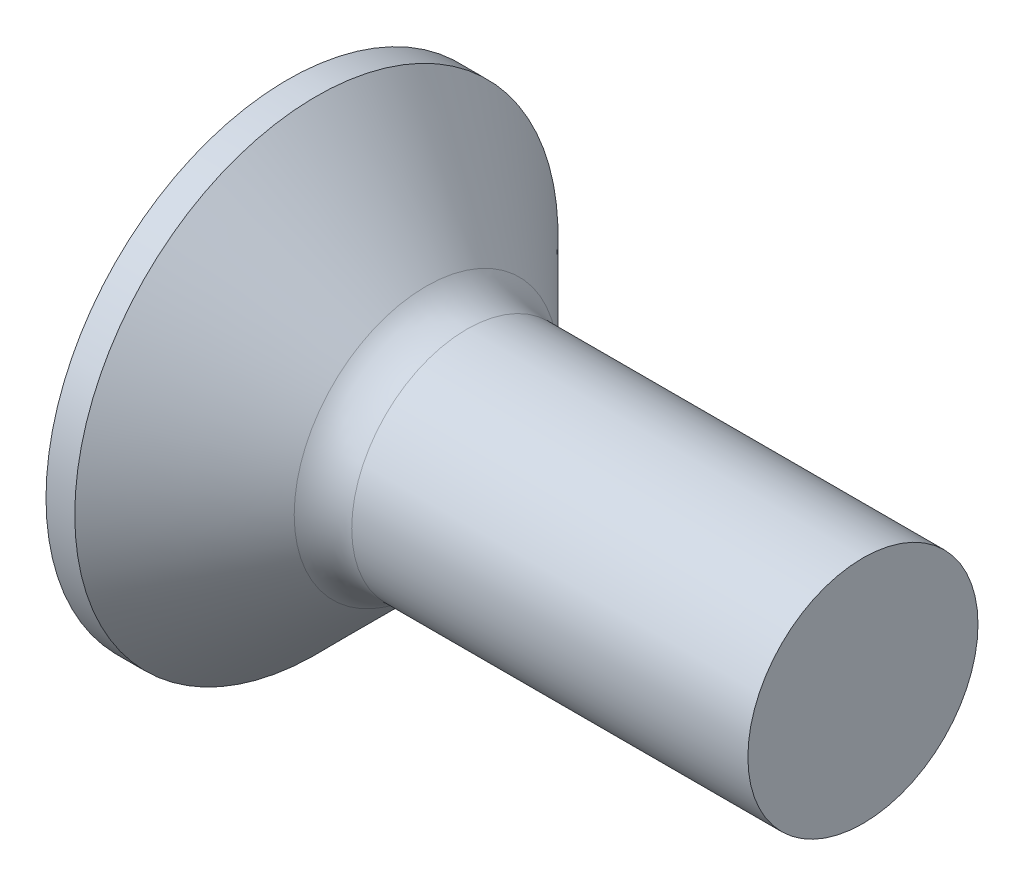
ISO-10303-21;
HEADER;
FILE_DESCRIPTION(('STEP AP214'),'2;1');
FILE_NAME('part.step','',(''),(''),'','','');
FILE_SCHEMA(('AUTOMOTIVE_DESIGN { 1 0 10303 214 1 1 1 1 }'));
ENDSEC;
DATA;
#1=APPLICATION_CONTEXT('core data for automotive mechanical design processes');
#2=APPLICATION_PROTOCOL_DEFINITION('international standard','automotive_design',2000,#1);
#3=PRODUCT_CONTEXT('',#1,'mechanical');
#4=PRODUCT('Part','Part','',(#3));
#5=PRODUCT_RELATED_PRODUCT_CATEGORY('part','',(#4));
#6=PRODUCT_DEFINITION_FORMATION('','',#4);
#7=PRODUCT_DEFINITION_CONTEXT('part definition',#1,'design');
#8=PRODUCT_DEFINITION('design','',#6,#7);
#9=PRODUCT_DEFINITION_SHAPE('','',#8);
#10=(LENGTH_UNIT() NAMED_UNIT(*) SI_UNIT(.MILLI.,.METRE.));
#11=(NAMED_UNIT(*) PLANE_ANGLE_UNIT() SI_UNIT($,.RADIAN.));
#12=(NAMED_UNIT(*) SI_UNIT($,.STERADIAN.) SOLID_ANGLE_UNIT());
#13=UNCERTAINTY_MEASURE_WITH_UNIT(LENGTH_MEASURE(1.E-05),#10,'distance_accuracy_value','');
#14=(GEOMETRIC_REPRESENTATION_CONTEXT(3) GLOBAL_UNCERTAINTY_ASSIGNED_CONTEXT((#13)) GLOBAL_UNIT_ASSIGNED_CONTEXT((#10,
#11,#12)) REPRESENTATION_CONTEXT('',''));
#15=CARTESIAN_POINT('',(0.,0.,0.));
#16=DIRECTION('',(0.,0.,1.));
#17=DIRECTION('',(1.,0.,0.));
#18=AXIS2_PLACEMENT_3D('',#15,#16,#17);
#19=CARTESIAN_POINT('',(2.51,-0.948560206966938,0.515));
#20=DIRECTION('',(0.,0.,-1.));
#21=DIRECTION('',(0.,1.,0.));
#22=AXIS2_PLACEMENT_3D('',#19,#20,#21);
#23=PLANE('',#22);
#24=DIRECTION('',(0.,-1.,0.));
#25=VECTOR('',#24,1.);
#26=CARTESIAN_POINT('',(0.,2.2,0.515));
#27=LINE('',#26,#25);
#28=CARTESIAN_POINT('',(0.,-0.887981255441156,0.515));
#29=VERTEX_POINT('',#28);
#30=CARTESIAN_POINT('',(0.,-2.2,0.515));
#31=VERTEX_POINT('',#30);
#32=EDGE_CURVE('E304',#29,#31,#27,.T.);
#33=ORIENTED_EDGE('',*,*,#32,.F.);
#34=CARTESIAN_POINT('',(-1.54977564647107,-1.01130800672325,0.515));
#35=CARTESIAN_POINT('',(-1.23788517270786,-0.986826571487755,0.515));
#36=CARTESIAN_POINT('',(-0.92600773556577,-0.962176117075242,0.515));
#37=CARTESIAN_POINT('',(-0.302275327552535,-0.912414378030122,0.515));
#38=CARTESIAN_POINT('',(0.0095796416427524,-0.88730307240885,0.515));
#39=CARTESIAN_POINT('',(0.477326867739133,-0.849200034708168,0.515));
#40=CARTESIAN_POINT('',(0.633236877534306,-0.836426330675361,0.515));
#41=CARTESIAN_POINT('',(0.945041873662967,-0.810710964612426,0.515));
#42=CARTESIAN_POINT('',(1.10093686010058,-0.797769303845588,0.515));
#43=CARTESIAN_POINT('',(1.41270333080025,-0.771692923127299,0.515));
#44=CARTESIAN_POINT('',(1.568574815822,-0.758558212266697,0.515));
#45=CARTESIAN_POINT('',(1.88030267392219,-0.732062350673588,0.515));
#46=CARTESIAN_POINT('',(2.03615904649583,-0.718701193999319,0.515));
#47=CARTESIAN_POINT('',(2.39015155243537,-0.688049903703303,0.515));
#48=CARTESIAN_POINT('',(2.58828060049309,-0.670677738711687,0.515));
#49=CARTESIAN_POINT('',(2.98448796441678,-0.63539350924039,0.515));
#50=CARTESIAN_POINT('',(3.18256628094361,-0.617481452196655,0.515));
#51=CARTESIAN_POINT('',(3.57863215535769,-0.58096323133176,0.515));
#52=CARTESIAN_POINT('',(3.77661972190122,-0.562357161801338,0.515));
#53=CARTESIAN_POINT('',(4.17251625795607,-0.524212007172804,0.515));
#54=CARTESIAN_POINT('',(4.37042522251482,-0.504672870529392,0.515));
#55=CARTESIAN_POINT('',(4.76621979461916,-0.464285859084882,0.515));
#56=CARTESIAN_POINT('',(4.96410533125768,-0.443437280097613,0.515000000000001));
#57=CARTESIAN_POINT('',(5.26075347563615,-0.410686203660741,0.515000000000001));
#58=CARTESIAN_POINT('',(5.35959766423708,-0.399523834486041,0.515000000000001));
#59=CARTESIAN_POINT('',(5.55721694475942,-0.376561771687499,0.515000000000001));
#60=CARTESIAN_POINT('',(5.65599203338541,-0.364762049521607,0.515000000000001));
#61=CARTESIAN_POINT('',(5.85350341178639,-0.340311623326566,0.515000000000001));
#62=CARTESIAN_POINT('',(5.95223963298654,-0.327660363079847,0.515000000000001));
#63=CARTESIAN_POINT('',(6.14954565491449,-0.301187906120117,0.515000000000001));
#64=CARTESIAN_POINT('',(6.24811547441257,-0.28736685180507,0.515000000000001));
#65=CARTESIAN_POINT('',(6.39580251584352,-0.265292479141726,0.515000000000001));
#66=CARTESIAN_POINT('',(6.44501926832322,-0.257707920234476,0.515000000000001));
#67=CARTESIAN_POINT('',(6.54335575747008,-0.241951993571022,0.515000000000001));
#68=CARTESIAN_POINT('',(6.59247550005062,-0.233780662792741,0.515000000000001));
#69=CARTESIAN_POINT('',(6.69060451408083,-0.216664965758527,0.515000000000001));
#70=CARTESIAN_POINT('',(6.73961373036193,-0.207720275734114,0.515000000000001));
#71=CARTESIAN_POINT('',(6.83741121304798,-0.188649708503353,0.515000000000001));
#72=CARTESIAN_POINT('',(6.8861994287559,-0.17852357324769,0.515000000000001));
#73=CARTESIAN_POINT('',(6.93482152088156,-0.167602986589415,0.515000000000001));
#74=B_SPLINE_CURVE_WITH_KNOTS('',3,(#34,#35,#36,#37,#38,#39,#40,#41,#42,#43,#44,#45,#46,#47,#48,
#49,#50,#51,#52,#53,#54,#55,#56,#57,#58,#59,#60,#61,#62,#63,#64,#65,#66,#67,#68,#69,#70,#71,#72,
#73),.UNSPECIFIED.,.F.,.F.,(4,2,2,2,2,2,2,2,2,2,2,2,2,2,2,2,2,2,2,4),(0.,0.938549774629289,
1.87714240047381,2.34643955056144,2.81573317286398,3.28500476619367,3.75428869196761,
4.35095567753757,4.94761444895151,5.54419244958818,6.14080344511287,6.73773807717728,
7.0361540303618,7.33458335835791,7.63320954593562,7.93179943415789,8.08118980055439,
8.23057076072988,8.38001456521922,8.52949107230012),.UNSPECIFIED.);
#75=CARTESIAN_POINT('',(2.51,-0.677477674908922,0.514999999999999));
#76=VERTEX_POINT('',#75);
#77=EDGE_CURVE('E191',#29,#76,#74,.T.);
#78=ORIENTED_EDGE('',*,*,#77,.T.);
#79=DIRECTION('',(0.,-1.,0.));
#80=VECTOR('',#79,1.);
#81=CARTESIAN_POINT('',(2.51,0.948560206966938,0.515));
#82=LINE('',#81,#80);
#83=CARTESIAN_POINT('',(2.51,-0.948560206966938,0.515));
#84=VERTEX_POINT('',#83);
#85=EDGE_CURVE('E328',#76,#84,#82,.T.);
#86=ORIENTED_EDGE('',*,*,#85,.T.);
#87=DIRECTION('',(0.89493436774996,0.446197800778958,0.));
#88=VECTOR('',#87,1.);
#89=CARTESIAN_POINT('',(0.,-2.2,0.515));
#90=LINE('',#89,#88);
#91=EDGE_CURVE('E315',#31,#84,#90,.T.);
#92=ORIENTED_EDGE('',*,*,#91,.F.);
#93=EDGE_LOOP('',(#33,#78,#86,#92));
#94=FACE_BOUND('',#93,.T.);
#95=ADVANCED_FACE('F35',(#94),#23,.T.);
#96=CARTESIAN_POINT('',(2.51,0.948560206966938,0.515));
#97=VERTEX_POINT('',#96);
#98=CARTESIAN_POINT('',(2.51,0.677477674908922,0.514999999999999));
#99=VERTEX_POINT('',#98);
#100=EDGE_CURVE('E330',#97,#99,#82,.T.);
#101=ORIENTED_EDGE('',*,*,#100,.T.);
#102=CARTESIAN_POINT('',(-1.54977564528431,1.01130800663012,0.515));
#103=CARTESIAN_POINT('',(-1.23788517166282,0.986826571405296,0.515));
#104=CARTESIAN_POINT('',(-0.926007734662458,0.962176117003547,0.515));
#105=CARTESIAN_POINT('',(-0.302275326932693,0.91241437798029,0.515));
#106=CARTESIAN_POINT('',(0.0095796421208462,0.887303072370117,0.515));
#107=CARTESIAN_POINT('',(0.477326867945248,0.849200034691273,0.515));
#108=CARTESIAN_POINT('',(0.63323687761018,0.836426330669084,0.515));
#109=CARTESIAN_POINT('',(0.945041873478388,0.810710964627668,0.515));
#110=CARTESIAN_POINT('',(1.10093685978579,0.797769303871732,0.515));
#111=CARTESIAN_POINT('',(1.41270333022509,0.771692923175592,0.515));
#112=CARTESIAN_POINT('',(1.56857481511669,0.758558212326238,0.515));
#113=CARTESIAN_POINT('',(1.8803026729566,0.732062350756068,0.515));
#114=CARTESIAN_POINT('',(2.03615904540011,0.718701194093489,0.515));
#115=CARTESIAN_POINT('',(2.39015155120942,0.688049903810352,0.515));
#116=CARTESIAN_POINT('',(2.58828059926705,0.670677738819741,0.515));
#117=CARTESIAN_POINT('',(2.98448796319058,0.635393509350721,0.515));
#118=CARTESIAN_POINT('',(3.18256627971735,0.617481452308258,0.515));
#119=CARTESIAN_POINT('',(3.57863215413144,0.580963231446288,0.515));
#120=CARTESIAN_POINT('',(3.77661972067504,0.56235716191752,0.515));
#121=CARTESIAN_POINT('',(4.17251625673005,0.524212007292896,0.515));
#122=CARTESIAN_POINT('',(4.37042522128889,0.504672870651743,0.515));
#123=CARTESIAN_POINT('',(4.76621979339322,0.464285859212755,0.515));
#124=CARTESIAN_POINT('',(4.96410533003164,0.443437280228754,0.515));
#125=CARTESIAN_POINT('',(5.26075347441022,0.410686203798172,0.515));
#126=CARTESIAN_POINT('',(5.35959766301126,0.399523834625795,0.515));
#127=CARTESIAN_POINT('',(5.5572169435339,0.376561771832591,0.515));
#128=CARTESIAN_POINT('',(5.65599203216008,0.364762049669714,0.515000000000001));
#129=CARTESIAN_POINT('',(5.85350341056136,0.340311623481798,0.515000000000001));
#130=CARTESIAN_POINT('',(5.95223963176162,0.327660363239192,0.515000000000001));
#131=CARTESIAN_POINT('',(6.14954565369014,0.301187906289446,0.515000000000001));
#132=CARTESIAN_POINT('',(6.24811547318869,0.28736685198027,0.515000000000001));
#133=CARTESIAN_POINT('',(6.39580251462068,0.265292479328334,0.515000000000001));
#134=CARTESIAN_POINT('',(6.44501926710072,0.257707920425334,0.515000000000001));
#135=CARTESIAN_POINT('',(6.54335575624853,0.241951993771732,0.515000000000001));
#136=CARTESIAN_POINT('',(6.5924754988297,0.233780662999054,0.515000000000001));
#137=CARTESIAN_POINT('',(6.69060451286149,0.216664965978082,0.515000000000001));
#138=CARTESIAN_POINT('',(6.73961372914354,0.207720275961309,0.515000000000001));
#139=CARTESIAN_POINT('',(6.83741121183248,0.18864970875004,0.515000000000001));
#140=CARTESIAN_POINT('',(6.88619942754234,0.178523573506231,0.515000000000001));
#141=CARTESIAN_POINT('',(6.9348215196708,0.167602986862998,0.515000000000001));
#142=B_SPLINE_CURVE_WITH_KNOTS('',3,(#102,#103,#104,#105,#106,#107,#108,#109,#110,#111,#112,
#113,#114,#115,#116,#117,#118,#119,#120,#121,#122,#123,#124,#125,#126,#127,#128,#129,#130,#131,
#132,#133,#134,#135,#136,#137,#138,#139,#140,#141),.UNSPECIFIED.,.F.,.F.,(4,2,2,2,2,2,2,2,2,2,2,
2,2,2,2,2,2,2,2,4),(0.,0.938549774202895,1.87714239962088,2.34643954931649,2.81573317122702,
3.2850047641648,3.75428868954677,4.35095567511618,4.9476144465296,5.544192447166,
6.1408034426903,6.73773807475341,7.03615402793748,7.33458335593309,7.63320954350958,
7.93179943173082,8.08118979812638,8.23057075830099,8.38001456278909,8.5294910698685),.UNSPECIFIED.);
#143=CARTESIAN_POINT('',(0.,0.887981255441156,0.515));
#144=VERTEX_POINT('',#143);
#145=EDGE_CURVE('E185',#99,#144,#142,.F.);
#146=ORIENTED_EDGE('',*,*,#145,.T.);
#147=CARTESIAN_POINT('',(0.,2.2,0.515));
#148=VERTEX_POINT('',#147);
#149=EDGE_CURVE('E306',#148,#144,#27,.T.);
#150=ORIENTED_EDGE('',*,*,#149,.F.);
#151=DIRECTION('',(0.89493436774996,-0.446197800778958,0.));
#152=VECTOR('',#151,1.);
#153=CARTESIAN_POINT('',(0.,2.2,0.515));
#154=LINE('',#153,#152);
#155=EDGE_CURVE('E63',#148,#97,#154,.T.);
#156=ORIENTED_EDGE('',*,*,#155,.T.);
#157=EDGE_LOOP('',(#101,#146,#150,#156));
#158=FACE_BOUND('',#157,.T.);
#159=ADVANCED_FACE('F167',(#158),#23,.T.);
#160=CARTESIAN_POINT('',(2.51,0.948560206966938,-0.515));
#161=DIRECTION('',(0.,0.,1.));
#162=DIRECTION('',(1.,0.,0.));
#163=AXIS2_PLACEMENT_3D('',#160,#161,#162);
#164=PLANE('',#163);
#165=DIRECTION('',(0.,1.,0.));
#166=VECTOR('',#165,1.);
#167=CARTESIAN_POINT('',(2.51,-0.948560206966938,-0.515));
#168=LINE('',#167,#166);
#169=CARTESIAN_POINT('',(2.51,-0.948560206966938,-0.515));
#170=VERTEX_POINT('',#169);
#171=CARTESIAN_POINT('',(2.51,-0.677477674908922,-0.514999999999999));
#172=VERTEX_POINT('',#171);
#173=EDGE_CURVE('E329',#170,#172,#168,.T.);
#174=ORIENTED_EDGE('',*,*,#173,.T.);
#175=CARTESIAN_POINT('',(-1.54977564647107,-1.01130800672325,-0.514999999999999));
#176=CARTESIAN_POINT('',(-1.23788517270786,-0.986826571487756,-0.514999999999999));
#177=CARTESIAN_POINT('',(-0.92600773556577,-0.962176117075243,-0.514999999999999));
#178=CARTESIAN_POINT('',(-0.302275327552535,-0.912414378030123,-0.514999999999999));
#179=CARTESIAN_POINT('',(0.00957964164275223,-0.88730307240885,-0.514999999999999));
#180=CARTESIAN_POINT('',(0.477326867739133,-0.849200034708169,-0.514999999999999));
#181=CARTESIAN_POINT('',(0.633236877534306,-0.836426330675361,-0.515));
#182=CARTESIAN_POINT('',(0.945041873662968,-0.810710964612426,-0.515));
#183=CARTESIAN_POINT('',(1.10093686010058,-0.797769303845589,-0.515));
#184=CARTESIAN_POINT('',(1.41270333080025,-0.771692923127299,-0.515));
#185=CARTESIAN_POINT('',(1.568574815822,-0.758558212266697,-0.515));
#186=CARTESIAN_POINT('',(1.88030267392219,-0.732062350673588,-0.515));
#187=CARTESIAN_POINT('',(2.03615904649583,-0.718701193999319,-0.515));
#188=CARTESIAN_POINT('',(2.39015155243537,-0.688049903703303,-0.515));
#189=CARTESIAN_POINT('',(2.58828060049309,-0.670677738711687,-0.515));
#190=CARTESIAN_POINT('',(2.98448796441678,-0.63539350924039,-0.515));
#191=CARTESIAN_POINT('',(3.18256628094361,-0.617481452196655,-0.515));
#192=CARTESIAN_POINT('',(3.57863215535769,-0.58096323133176,-0.515));
#193=CARTESIAN_POINT('',(3.77661972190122,-0.562357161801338,-0.515));
#194=CARTESIAN_POINT('',(4.17251625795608,-0.524212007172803,-0.515000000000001));
#195=CARTESIAN_POINT('',(4.37042522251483,-0.504672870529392,-0.515000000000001));
#196=CARTESIAN_POINT('',(4.76621979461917,-0.464285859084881,-0.515000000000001));
#197=CARTESIAN_POINT('',(4.96410533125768,-0.443437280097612,-0.515000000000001));
#198=CARTESIAN_POINT('',(5.26075347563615,-0.410686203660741,-0.515000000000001));
#199=CARTESIAN_POINT('',(5.35959766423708,-0.39952383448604,-0.515000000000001));
#200=CARTESIAN_POINT('',(5.55721694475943,-0.376561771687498,-0.515000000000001));
#201=CARTESIAN_POINT('',(5.65599203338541,-0.364762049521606,-0.515000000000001));
#202=CARTESIAN_POINT('',(5.8535034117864,-0.340311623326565,-0.515000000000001));
#203=CARTESIAN_POINT('',(5.95223963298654,-0.327660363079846,-0.515000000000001));
#204=CARTESIAN_POINT('',(6.14954565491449,-0.301187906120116,-0.515000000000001));
#205=CARTESIAN_POINT('',(6.24811547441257,-0.287366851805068,-0.515000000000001));
#206=CARTESIAN_POINT('',(6.39580251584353,-0.265292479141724,-0.515000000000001));
#207=CARTESIAN_POINT('',(6.44501926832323,-0.257707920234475,-0.515000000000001));
#208=CARTESIAN_POINT('',(6.54335575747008,-0.24195199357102,-0.515000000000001));
#209=CARTESIAN_POINT('',(6.59247550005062,-0.233780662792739,-0.515000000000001));
#210=CARTESIAN_POINT('',(6.69060451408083,-0.216664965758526,-0.515000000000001));
#211=CARTESIAN_POINT('',(6.73961373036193,-0.207720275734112,-0.515000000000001));
#212=CARTESIAN_POINT('',(6.83741121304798,-0.188649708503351,-0.515000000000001));
#213=CARTESIAN_POINT('',(6.88619942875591,-0.178523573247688,-0.515000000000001));
#214=CARTESIAN_POINT('',(6.93482152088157,-0.167602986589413,-0.515000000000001));
#215=B_SPLINE_CURVE_WITH_KNOTS('',3,(#175,#176,#177,#178,#179,#180,#181,#182,#183,#184,#185,
#186,#187,#188,#189,#190,#191,#192,#193,#194,#195,#196,#197,#198,#199,#200,#201,#202,#203,#204,
#205,#206,#207,#208,#209,#210,#211,#212,#213,#214),.UNSPECIFIED.,.F.,.F.,(4,2,2,2,2,2,2,2,2,2,2,
2,2,2,2,2,2,2,2,4),(0.,0.938549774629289,1.87714240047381,2.34643955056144,2.81573317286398,
3.28500476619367,3.75428869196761,4.35095567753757,4.94761444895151,5.54419244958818,
6.14080344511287,6.73773807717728,7.0361540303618,7.33458335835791,7.63320954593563,
7.93179943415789,8.0811898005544,8.23057076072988,8.38001456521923,8.52949107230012),.UNSPECIFIED.);
#216=CARTESIAN_POINT('',(0.,-0.887981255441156,-0.514999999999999));
#217=VERTEX_POINT('',#216);
#218=EDGE_CURVE('E232',#172,#217,#215,.F.);
#219=ORIENTED_EDGE('',*,*,#218,.T.);
#220=DIRECTION('',(0.,1.,0.));
#221=VECTOR('',#220,1.);
#222=CARTESIAN_POINT('',(0.,-2.2,-0.514999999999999));
#223=LINE('',#222,#221);
#224=CARTESIAN_POINT('',(0.,-2.2,-0.514999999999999));
#225=VERTEX_POINT('',#224);
#226=EDGE_CURVE('E305',#225,#217,#223,.T.);
#227=ORIENTED_EDGE('',*,*,#226,.F.);
#228=DIRECTION('',(0.89493436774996,0.446197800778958,0.));
#229=VECTOR('',#228,1.);
#230=CARTESIAN_POINT('',(0.,-2.2,-0.514999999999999));
#231=LINE('',#230,#229);
#232=EDGE_CURVE('E318',#225,#170,#231,.T.);
#233=ORIENTED_EDGE('',*,*,#232,.T.);
#234=EDGE_LOOP('',(#174,#219,#227,#233));
#235=FACE_BOUND('',#234,.T.);
#236=ADVANCED_FACE('F173',(#235),#164,.T.);
#237=CARTESIAN_POINT('',(0.,0.887981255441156,-0.514999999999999));
#238=VERTEX_POINT('',#237);
#239=CARTESIAN_POINT('',(0.,2.2,-0.514999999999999));
#240=VERTEX_POINT('',#239);
#241=EDGE_CURVE('E314',#238,#240,#223,.T.);
#242=ORIENTED_EDGE('',*,*,#241,.F.);
#243=CARTESIAN_POINT('',(-1.54977564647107,1.01130800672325,-0.514999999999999));
#244=CARTESIAN_POINT('',(-1.23788517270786,0.986826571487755,-0.514999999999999));
#245=CARTESIAN_POINT('',(-0.92600773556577,0.962176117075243,-0.514999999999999));
#246=CARTESIAN_POINT('',(-0.302275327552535,0.912414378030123,-0.514999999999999));
#247=CARTESIAN_POINT('',(0.00957964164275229,0.88730307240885,-0.514999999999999));
#248=CARTESIAN_POINT('',(0.477326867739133,0.849200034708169,-0.514999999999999));
#249=CARTESIAN_POINT('',(0.633236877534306,0.836426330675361,-0.515));
#250=CARTESIAN_POINT('',(0.945041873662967,0.810710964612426,-0.515));
#251=CARTESIAN_POINT('',(1.10093686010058,0.797769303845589,-0.515));
#252=CARTESIAN_POINT('',(1.41270333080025,0.771692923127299,-0.515));
#253=CARTESIAN_POINT('',(1.568574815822,0.758558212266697,-0.515));
#254=CARTESIAN_POINT('',(1.88030267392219,0.732062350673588,-0.515));
#255=CARTESIAN_POINT('',(2.03615904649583,0.718701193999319,-0.515));
#256=CARTESIAN_POINT('',(2.39015155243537,0.688049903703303,-0.515));
#257=CARTESIAN_POINT('',(2.58828060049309,0.670677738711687,-0.515));
#258=CARTESIAN_POINT('',(2.98448796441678,0.63539350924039,-0.515));
#259=CARTESIAN_POINT('',(3.18256628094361,0.617481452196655,-0.515));
#260=CARTESIAN_POINT('',(3.57863215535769,0.58096323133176,-0.515));
#261=CARTESIAN_POINT('',(3.77661972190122,0.562357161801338,-0.515));
#262=CARTESIAN_POINT('',(4.17251625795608,0.524212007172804,-0.515000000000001));
#263=CARTESIAN_POINT('',(4.37042522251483,0.504672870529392,-0.515000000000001));
#264=CARTESIAN_POINT('',(4.76621979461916,0.464285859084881,-0.515000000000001));
#265=CARTESIAN_POINT('',(4.96410533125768,0.443437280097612,-0.515000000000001));
#266=CARTESIAN_POINT('',(5.26075347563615,0.410686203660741,-0.515000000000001));
#267=CARTESIAN_POINT('',(5.35959766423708,0.39952383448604,-0.515000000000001));
#268=CARTESIAN_POINT('',(5.55721694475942,0.376561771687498,-0.515000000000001));
#269=CARTESIAN_POINT('',(5.65599203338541,0.364762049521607,-0.515000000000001));
#270=CARTESIAN_POINT('',(5.8535034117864,0.340311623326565,-0.515000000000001));
#271=CARTESIAN_POINT('',(5.95223963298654,0.327660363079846,-0.515000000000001));
#272=CARTESIAN_POINT('',(6.14954565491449,0.301187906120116,-0.515000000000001));
#273=CARTESIAN_POINT('',(6.24811547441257,0.287366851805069,-0.515000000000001));
#274=CARTESIAN_POINT('',(6.39580251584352,0.265292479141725,-0.515000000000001));
#275=CARTESIAN_POINT('',(6.44501926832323,0.257707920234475,-0.515000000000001));
#276=CARTESIAN_POINT('',(6.54335575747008,0.24195199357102,-0.515000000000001));
#277=CARTESIAN_POINT('',(6.59247550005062,0.233780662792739,-0.515000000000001));
#278=CARTESIAN_POINT('',(6.69060451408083,0.216664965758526,-0.515000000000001));
#279=CARTESIAN_POINT('',(6.73961373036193,0.207720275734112,-0.515000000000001));
#280=CARTESIAN_POINT('',(6.83741121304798,0.188649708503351,-0.515000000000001));
#281=CARTESIAN_POINT('',(6.88619942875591,0.178523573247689,-0.515000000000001));
#282=CARTESIAN_POINT('',(6.93482152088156,0.167602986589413,-0.515000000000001));
#283=B_SPLINE_CURVE_WITH_KNOTS('',3,(#243,#244,#245,#246,#247,#248,#249,#250,#251,#252,#253,
#254,#255,#256,#257,#258,#259,#260,#261,#262,#263,#264,#265,#266,#267,#268,#269,#270,#271,#272,
#273,#274,#275,#276,#277,#278,#279,#280,#281,#282),.UNSPECIFIED.,.F.,.F.,(4,2,2,2,2,2,2,2,2,2,2,
2,2,2,2,2,2,2,2,4),(0.,0.938549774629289,1.87714240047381,2.34643955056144,2.81573317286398,
3.28500476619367,3.75428869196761,4.35095567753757,4.94761444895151,5.54419244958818,
6.14080344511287,6.73773807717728,7.0361540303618,7.33458335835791,7.63320954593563,
7.93179943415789,8.0811898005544,8.23057076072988,8.38001456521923,8.52949107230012),.UNSPECIFIED.);
#284=CARTESIAN_POINT('',(2.51,0.677477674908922,-0.514999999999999));
#285=VERTEX_POINT('',#284);
#286=EDGE_CURVE('E228',#238,#285,#283,.T.);
#287=ORIENTED_EDGE('',*,*,#286,.T.);
#288=CARTESIAN_POINT('',(2.51,0.948560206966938,-0.515));
#289=VERTEX_POINT('',#288);
#290=EDGE_CURVE('E335',#285,#289,#168,.T.);
#291=ORIENTED_EDGE('',*,*,#290,.T.);
#292=DIRECTION('',(0.89493436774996,-0.446197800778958,0.));
#293=VECTOR('',#292,1.);
#294=CARTESIAN_POINT('',(0.,2.2,-0.514999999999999));
#295=LINE('',#294,#293);
#296=EDGE_CURVE('E322',#240,#289,#295,.T.);
#297=ORIENTED_EDGE('',*,*,#296,.F.);
#298=EDGE_LOOP('',(#242,#287,#291,#297));
#299=FACE_BOUND('',#298,.T.);
#300=ADVANCED_FACE('F453',(#299),#164,.T.);
#301=CARTESIAN_POINT('',(2.51,-0.948560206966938,-0.515));
#302=DIRECTION('',(-1.,0.,0.));
#303=DIRECTION('',(0.,0.,1.));
#304=AXIS2_PLACEMENT_3D('',#301,#302,#303);
#305=PLANE('',#304);
#306=ORIENTED_EDGE('',*,*,#85,.F.);
#307=CARTESIAN_POINT('',(2.51,0.,0.));
#308=DIRECTION('',(-1.,0.,0.));
#309=DIRECTION('',(0.,0.,1.));
#310=AXIS2_PLACEMENT_3D('',#307,#308,#309);
#311=CIRCLE('',#310,0.850999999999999);
#312=EDGE_CURVE('E275',#172,#76,#311,.T.);
#313=ORIENTED_EDGE('',*,*,#312,.F.);
#314=ORIENTED_EDGE('',*,*,#173,.F.);
#315=DIRECTION('',(0.,0.,-1.));
#316=VECTOR('',#315,1.);
#317=CARTESIAN_POINT('',(2.51,-0.948560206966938,0.515));
#318=LINE('',#317,#316);
#319=EDGE_CURVE('E325',#84,#170,#318,.T.);
#320=ORIENTED_EDGE('',*,*,#319,.F.);
#321=EDGE_LOOP('',(#306,#313,#314,#320));
#322=FACE_BOUND('',#321,.T.);
#323=ADVANCED_FACE('F446',(#322),#305,.T.);
#324=DIRECTION('',(0.,0.,-1.));
#325=VECTOR('',#324,1.);
#326=CARTESIAN_POINT('',(2.51,-0.515000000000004,0.948560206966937));
#327=LINE('',#326,#325);
#328=CARTESIAN_POINT('',(2.51,-0.514999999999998,-0.677477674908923));
#329=VERTEX_POINT('',#328);
#330=CARTESIAN_POINT('',(2.51,-0.514999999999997,-0.94856020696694));
#331=VERTEX_POINT('',#330);
#332=EDGE_CURVE('E290',#329,#331,#327,.T.);
#333=ORIENTED_EDGE('',*,*,#332,.F.);
#334=CARTESIAN_POINT('',(2.51,0.515000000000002,-0.677477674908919));
#335=VERTEX_POINT('',#334);
#336=EDGE_CURVE('E280',#335,#329,#311,.T.);
#337=ORIENTED_EDGE('',*,*,#336,.F.);
#338=DIRECTION('',(0.,0.,1.));
#339=VECTOR('',#338,1.);
#340=CARTESIAN_POINT('',(2.51,0.515000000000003,-0.948560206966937));
#341=LINE('',#340,#339);
#342=CARTESIAN_POINT('',(2.51,0.515000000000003,-0.948560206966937));
#343=VERTEX_POINT('',#342);
#344=EDGE_CURVE('E288',#343,#335,#341,.T.);
#345=ORIENTED_EDGE('',*,*,#344,.F.);
#346=DIRECTION('',(0.,1.,0.));
#347=VECTOR('',#346,1.);
#348=CARTESIAN_POINT('',(2.51,-0.514999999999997,-0.94856020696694));
#349=LINE('',#348,#347);
#350=EDGE_CURVE('E299',#331,#343,#349,.T.);
#351=ORIENTED_EDGE('',*,*,#350,.F.);
#352=EDGE_LOOP('',(#333,#337,#345,#351));
#353=FACE_BOUND('',#352,.T.);
#354=ADVANCED_FACE('F286',(#353),#305,.T.);
#355=ORIENTED_EDGE('',*,*,#290,.F.);
#356=EDGE_CURVE('E267',#99,#285,#311,.T.);
#357=ORIENTED_EDGE('',*,*,#356,.F.);
#358=ORIENTED_EDGE('',*,*,#100,.F.);
#359=DIRECTION('',(0.,0.,1.));
#360=VECTOR('',#359,1.);
#361=CARTESIAN_POINT('',(2.51,0.948560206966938,-0.515));
#362=LINE('',#361,#360);
#363=EDGE_CURVE('E326',#289,#97,#362,.T.);
#364=ORIENTED_EDGE('',*,*,#363,.F.);
#365=EDGE_LOOP('',(#355,#357,#358,#364));
#366=FACE_BOUND('',#365,.T.);
#367=ADVANCED_FACE('F426',(#366),#305,.T.);
#368=CARTESIAN_POINT('',(2.51,-0.514999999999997,-0.94856020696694));
#369=DIRECTION('',(0.,1.,0.));
#370=DIRECTION('',(0.,0.,1.));
#371=AXIS2_PLACEMENT_3D('',#368,#369,#370);
#372=PLANE('',#371);
#373=DIRECTION('',(0.,0.,-1.));
#374=VECTOR('',#373,1.);
#375=CARTESIAN_POINT('',(0.,-0.515000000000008,2.2));
#376=LINE('',#375,#374);
#377=CARTESIAN_POINT('',(0.,-0.514999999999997,-0.887981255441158));
#378=VERTEX_POINT('',#377);
#379=CARTESIAN_POINT('',(0.,-0.514999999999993,-2.2));
#380=VERTEX_POINT('',#379);
#381=EDGE_CURVE('E379',#378,#380,#376,.T.);
#382=ORIENTED_EDGE('',*,*,#381,.F.);
#383=CARTESIAN_POINT('',(-1.54977564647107,-0.514999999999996,-1.01130800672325));
#384=CARTESIAN_POINT('',(-1.23788517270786,-0.514999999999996,-0.986826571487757));
#385=CARTESIAN_POINT('',(-0.92600773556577,-0.514999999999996,-0.962176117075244));
#386=CARTESIAN_POINT('',(-0.302275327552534,-0.514999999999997,-0.912414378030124));
#387=CARTESIAN_POINT('',(0.00957964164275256,-0.514999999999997,-0.887303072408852));
#388=CARTESIAN_POINT('',(0.477326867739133,-0.514999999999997,-0.84920003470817));
#389=CARTESIAN_POINT('',(0.633236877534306,-0.514999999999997,-0.836426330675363));
#390=CARTESIAN_POINT('',(0.945041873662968,-0.514999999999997,-0.810710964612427));
#391=CARTESIAN_POINT('',(1.10093686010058,-0.514999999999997,-0.79776930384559));
#392=CARTESIAN_POINT('',(1.41270333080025,-0.514999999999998,-0.771692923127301));
#393=CARTESIAN_POINT('',(1.568574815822,-0.514999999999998,-0.758558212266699));
#394=CARTESIAN_POINT('',(1.88030267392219,-0.514999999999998,-0.73206235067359));
#395=CARTESIAN_POINT('',(2.03615904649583,-0.514999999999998,-0.718701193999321));
#396=CARTESIAN_POINT('',(2.39015155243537,-0.514999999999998,-0.688049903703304));
#397=CARTESIAN_POINT('',(2.58828060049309,-0.514999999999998,-0.670677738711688));
#398=CARTESIAN_POINT('',(2.98448796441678,-0.514999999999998,-0.635393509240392));
#399=CARTESIAN_POINT('',(3.18256628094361,-0.514999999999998,-0.617481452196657));
#400=CARTESIAN_POINT('',(3.57863215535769,-0.514999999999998,-0.580963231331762));
#401=CARTESIAN_POINT('',(3.77661972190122,-0.514999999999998,-0.56235716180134));
#402=CARTESIAN_POINT('',(4.17251625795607,-0.514999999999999,-0.524212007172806));
#403=CARTESIAN_POINT('',(4.37042522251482,-0.514999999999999,-0.504672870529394));
#404=CARTESIAN_POINT('',(4.76621979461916,-0.514999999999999,-0.464285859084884));
#405=CARTESIAN_POINT('',(4.96410533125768,-0.514999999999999,-0.443437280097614));
#406=CARTESIAN_POINT('',(5.26075347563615,-0.514999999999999,-0.410686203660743));
#407=CARTESIAN_POINT('',(5.35959766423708,-0.514999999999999,-0.399523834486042));
#408=CARTESIAN_POINT('',(5.55721694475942,-0.514999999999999,-0.3765617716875));
#409=CARTESIAN_POINT('',(5.65599203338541,-0.514999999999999,-0.364762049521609));
#410=CARTESIAN_POINT('',(5.8535034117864,-0.514999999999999,-0.340311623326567));
#411=CARTESIAN_POINT('',(5.95223963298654,-0.514999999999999,-0.327660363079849));
#412=CARTESIAN_POINT('',(6.14954565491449,-0.515,-0.301187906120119));
#413=CARTESIAN_POINT('',(6.24811547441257,-0.515,-0.287366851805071));
#414=CARTESIAN_POINT('',(6.39580251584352,-0.515,-0.265292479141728));
#415=CARTESIAN_POINT('',(6.44501926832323,-0.515,-0.257707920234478));
#416=CARTESIAN_POINT('',(6.54335575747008,-0.515,-0.241951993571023));
#417=CARTESIAN_POINT('',(6.59247550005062,-0.515,-0.233780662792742));
#418=CARTESIAN_POINT('',(6.69060451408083,-0.515,-0.216664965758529));
#419=CARTESIAN_POINT('',(6.73961373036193,-0.515,-0.207720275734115));
#420=CARTESIAN_POINT('',(6.83741121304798,-0.515,-0.188649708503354));
#421=CARTESIAN_POINT('',(6.88619942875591,-0.515,-0.178523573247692));
#422=CARTESIAN_POINT('',(6.93482152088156,-0.515,-0.167602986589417));
#423=B_SPLINE_CURVE_WITH_KNOTS('',3,(#383,#384,#385,#386,#387,#388,#389,#390,#391,#392,#393,
#394,#395,#396,#397,#398,#399,#400,#401,#402,#403,#404,#405,#406,#407,#408,#409,#410,#411,#412,
#413,#414,#415,#416,#417,#418,#419,#420,#421,#422),.UNSPECIFIED.,.F.,.F.,(4,2,2,2,2,2,2,2,2,2,2,
2,2,2,2,2,2,2,2,4),(0.,0.938549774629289,1.87714240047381,2.34643955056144,2.81573317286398,
3.28500476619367,3.75428869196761,4.35095567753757,4.94761444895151,5.54419244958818,
6.14080344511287,6.73773807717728,7.03615403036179,7.33458335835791,7.63320954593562,
7.93179943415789,8.08118980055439,8.23057076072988,8.38001456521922,8.52949107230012),.UNSPECIFIED.);
#424=EDGE_CURVE('E222',#378,#329,#423,.T.);
#425=ORIENTED_EDGE('',*,*,#424,.T.);
#426=ORIENTED_EDGE('',*,*,#332,.T.);
#427=DIRECTION('',(0.89493436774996,0.,0.446197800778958));
#428=VECTOR('',#427,1.);
#429=CARTESIAN_POINT('',(0.,-0.514999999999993,-2.2));
#430=LINE('',#429,#428);
#431=EDGE_CURVE('E386',#380,#331,#430,.T.);
#432=ORIENTED_EDGE('',*,*,#431,.F.);
#433=EDGE_LOOP('',(#382,#425,#426,#432));
#434=FACE_BOUND('',#433,.T.);
#435=ADVANCED_FACE('F397',(#434),#372,.T.);
#436=CARTESIAN_POINT('',(2.51,0.514999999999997,0.94856020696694));
#437=DIRECTION('',(0.,-1.,0.));
#438=DIRECTION('',(1.,0.,0.));
#439=AXIS2_PLACEMENT_3D('',#436,#437,#438);
#440=PLANE('',#439);
#441=ORIENTED_EDGE('',*,*,#344,.T.);
#442=CARTESIAN_POINT('',(-1.54977564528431,0.515000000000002,-1.01130800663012));
#443=CARTESIAN_POINT('',(-1.23788517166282,0.515000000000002,-0.986826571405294));
#444=CARTESIAN_POINT('',(-0.926007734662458,0.515000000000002,-0.962176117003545));
#445=CARTESIAN_POINT('',(-0.302275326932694,0.515000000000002,-0.912414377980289));
#446=CARTESIAN_POINT('',(0.00957964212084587,0.515000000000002,-0.887303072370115));
#447=CARTESIAN_POINT('',(0.477326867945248,0.515000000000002,-0.849200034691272));
#448=CARTESIAN_POINT('',(0.63323687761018,0.515000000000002,-0.836426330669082));
#449=CARTESIAN_POINT('',(0.945041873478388,0.515000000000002,-0.810710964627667));
#450=CARTESIAN_POINT('',(1.10093685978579,0.515000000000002,-0.79776930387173));
#451=CARTESIAN_POINT('',(1.41270333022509,0.515000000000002,-0.77169292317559));
#452=CARTESIAN_POINT('',(1.56857481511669,0.515000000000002,-0.758558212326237));
#453=CARTESIAN_POINT('',(1.8803026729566,0.515000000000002,-0.732062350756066));
#454=CARTESIAN_POINT('',(2.03615904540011,0.515000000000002,-0.718701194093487));
#455=CARTESIAN_POINT('',(2.39015155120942,0.515000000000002,-0.68804990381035));
#456=CARTESIAN_POINT('',(2.58828059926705,0.515000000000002,-0.670677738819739));
#457=CARTESIAN_POINT('',(2.98448796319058,0.515000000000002,-0.635393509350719));
#458=CARTESIAN_POINT('',(3.18256627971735,0.515000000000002,-0.617481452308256));
#459=CARTESIAN_POINT('',(3.57863215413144,0.515000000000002,-0.580963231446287));
#460=CARTESIAN_POINT('',(3.77661972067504,0.515000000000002,-0.562357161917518));
#461=CARTESIAN_POINT('',(4.17251625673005,0.515000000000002,-0.524212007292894));
#462=CARTESIAN_POINT('',(4.37042522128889,0.515000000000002,-0.504672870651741));
#463=CARTESIAN_POINT('',(4.76621979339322,0.515000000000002,-0.464285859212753));
#464=CARTESIAN_POINT('',(4.96410533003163,0.515000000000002,-0.443437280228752));
#465=CARTESIAN_POINT('',(5.26075347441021,0.515000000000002,-0.410686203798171));
#466=CARTESIAN_POINT('',(5.35959766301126,0.515000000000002,-0.399523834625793));
#467=CARTESIAN_POINT('',(5.5572169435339,0.515000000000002,-0.376561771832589));
#468=CARTESIAN_POINT('',(5.65599203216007,0.515000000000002,-0.364762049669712));
#469=CARTESIAN_POINT('',(5.85350341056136,0.515000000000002,-0.340311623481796));
#470=CARTESIAN_POINT('',(5.95223963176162,0.515000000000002,-0.32766036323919));
#471=CARTESIAN_POINT('',(6.14954565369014,0.515000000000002,-0.301187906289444));
#472=CARTESIAN_POINT('',(6.24811547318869,0.515000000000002,-0.287366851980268));
#473=CARTESIAN_POINT('',(6.39580251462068,0.515000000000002,-0.265292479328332));
#474=CARTESIAN_POINT('',(6.44501926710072,0.515000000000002,-0.257707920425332));
#475=CARTESIAN_POINT('',(6.54335575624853,0.515000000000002,-0.24195199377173));
#476=CARTESIAN_POINT('',(6.5924754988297,0.515000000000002,-0.233780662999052));
#477=CARTESIAN_POINT('',(6.69060451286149,0.515000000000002,-0.216664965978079));
#478=CARTESIAN_POINT('',(6.73961372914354,0.515000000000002,-0.207720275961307));
#479=CARTESIAN_POINT('',(6.83741121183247,0.515000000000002,-0.188649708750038));
#480=CARTESIAN_POINT('',(6.88619942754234,0.515000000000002,-0.178523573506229));
#481=CARTESIAN_POINT('',(6.9348215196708,0.515000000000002,-0.167602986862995));
#482=B_SPLINE_CURVE_WITH_KNOTS('',3,(#442,#443,#444,#445,#446,#447,#448,#449,#450,#451,#452,
#453,#454,#455,#456,#457,#458,#459,#460,#461,#462,#463,#464,#465,#466,#467,#468,#469,#470,#471,
#472,#473,#474,#475,#476,#477,#478,#479,#480,#481),.UNSPECIFIED.,.F.,.F.,(4,2,2,2,2,2,2,2,2,2,2,
2,2,2,2,2,2,2,2,4),(0.,0.938549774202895,1.87714239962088,2.34643954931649,2.81573317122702,
3.2850047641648,3.75428868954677,4.35095567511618,4.9476144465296,5.544192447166,
6.1408034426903,6.7377380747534,7.03615402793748,7.33458335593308,7.63320954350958,
7.93179943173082,8.08118979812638,8.23057075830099,8.38001456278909,8.5294910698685),.UNSPECIFIED.);
#483=CARTESIAN_POINT('',(0.,0.515000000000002,-0.887981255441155));
#484=VERTEX_POINT('',#483);
#485=EDGE_CURVE('E216',#335,#484,#482,.F.);
#486=ORIENTED_EDGE('',*,*,#485,.T.);
#487=DIRECTION('',(0.,0.,1.));
#488=VECTOR('',#487,1.);
#489=CARTESIAN_POINT('',(0.,0.515000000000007,-2.2));
#490=LINE('',#489,#488);
#491=CARTESIAN_POINT('',(0.,0.515000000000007,-2.2));
#492=VERTEX_POINT('',#491);
#493=EDGE_CURVE('E383',#492,#484,#490,.T.);
#494=ORIENTED_EDGE('',*,*,#493,.F.);
#495=DIRECTION('',(0.89493436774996,0.,0.446197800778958));
#496=VECTOR('',#495,1.);
#497=CARTESIAN_POINT('',(0.,0.515000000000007,-2.2));
#498=LINE('',#497,#496);
#499=EDGE_CURVE('E292',#492,#343,#498,.T.);
#500=ORIENTED_EDGE('',*,*,#499,.T.);
#501=EDGE_LOOP('',(#441,#486,#494,#500));
#502=FACE_BOUND('',#501,.T.);
#503=ADVANCED_FACE('F291',(#502),#440,.T.);
#504=CARTESIAN_POINT('',(2.51,-0.515000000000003,0.948560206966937));
#505=VERTEX_POINT('',#504);
#506=CARTESIAN_POINT('',(2.51,-0.515000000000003,0.677477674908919));
#507=VERTEX_POINT('',#506);
#508=EDGE_CURVE('E394',#505,#507,#327,.T.);
#509=ORIENTED_EDGE('',*,*,#508,.T.);
#510=CARTESIAN_POINT('',(-1.54977564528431,-0.515000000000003,1.01130800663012));
#511=CARTESIAN_POINT('',(-1.23788517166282,-0.515000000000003,0.986826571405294));
#512=CARTESIAN_POINT('',(-0.926007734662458,-0.515000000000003,0.962176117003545));
#513=CARTESIAN_POINT('',(-0.302275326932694,-0.515000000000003,0.912414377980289));
#514=CARTESIAN_POINT('',(0.00957964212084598,-0.515000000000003,0.887303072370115));
#515=CARTESIAN_POINT('',(0.477326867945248,-0.515000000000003,0.849200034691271));
#516=CARTESIAN_POINT('',(0.633236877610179,-0.515000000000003,0.836426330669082));
#517=CARTESIAN_POINT('',(0.945041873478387,-0.515000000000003,0.810710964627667));
#518=CARTESIAN_POINT('',(1.10093685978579,-0.515000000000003,0.79776930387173));
#519=CARTESIAN_POINT('',(1.41270333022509,-0.515000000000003,0.77169292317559));
#520=CARTESIAN_POINT('',(1.56857481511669,-0.515000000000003,0.758558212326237));
#521=CARTESIAN_POINT('',(1.8803026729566,-0.515000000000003,0.732062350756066));
#522=CARTESIAN_POINT('',(2.03615904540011,-0.515000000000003,0.718701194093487));
#523=CARTESIAN_POINT('',(2.39015155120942,-0.515000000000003,0.68804990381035));
#524=CARTESIAN_POINT('',(2.58828059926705,-0.515000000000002,0.670677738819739));
#525=CARTESIAN_POINT('',(2.98448796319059,-0.515000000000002,0.635393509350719));
#526=CARTESIAN_POINT('',(3.18256627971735,-0.515000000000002,0.617481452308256));
#527=CARTESIAN_POINT('',(3.57863215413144,-0.515000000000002,0.580963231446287));
#528=CARTESIAN_POINT('',(3.77661972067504,-0.515000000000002,0.562357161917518));
#529=CARTESIAN_POINT('',(4.17251625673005,-0.515000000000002,0.524212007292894));
#530=CARTESIAN_POINT('',(4.37042522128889,-0.515000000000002,0.504672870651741));
#531=CARTESIAN_POINT('',(4.76621979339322,-0.515000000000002,0.464285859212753));
#532=CARTESIAN_POINT('',(4.96410533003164,-0.515000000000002,0.443437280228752));
#533=CARTESIAN_POINT('',(5.26075347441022,-0.515000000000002,0.410686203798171));
#534=CARTESIAN_POINT('',(5.35959766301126,-0.515000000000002,0.399523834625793));
#535=CARTESIAN_POINT('',(5.5572169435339,-0.515000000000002,0.376561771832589));
#536=CARTESIAN_POINT('',(5.65599203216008,-0.515000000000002,0.364762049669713));
#537=CARTESIAN_POINT('',(5.85350341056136,-0.515000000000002,0.340311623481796));
#538=CARTESIAN_POINT('',(5.95223963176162,-0.515000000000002,0.32766036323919));
#539=CARTESIAN_POINT('',(6.14954565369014,-0.515000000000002,0.301187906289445));
#540=CARTESIAN_POINT('',(6.24811547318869,-0.515000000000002,0.287366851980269));
#541=CARTESIAN_POINT('',(6.39580251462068,-0.515000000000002,0.265292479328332));
#542=CARTESIAN_POINT('',(6.44501926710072,-0.515000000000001,0.257707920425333));
#543=CARTESIAN_POINT('',(6.54335575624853,-0.515000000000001,0.24195199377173));
#544=CARTESIAN_POINT('',(6.5924754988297,-0.515000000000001,0.233780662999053));
#545=CARTESIAN_POINT('',(6.69060451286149,-0.515000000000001,0.21666496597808));
#546=CARTESIAN_POINT('',(6.73961372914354,-0.515000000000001,0.207720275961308));
#547=CARTESIAN_POINT('',(6.83741121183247,-0.515000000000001,0.188649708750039));
#548=CARTESIAN_POINT('',(6.88619942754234,-0.515000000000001,0.17852357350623));
#549=CARTESIAN_POINT('',(6.9348215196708,-0.515000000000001,0.167602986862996));
#550=B_SPLINE_CURVE_WITH_KNOTS('',3,(#510,#511,#512,#513,#514,#515,#516,#517,#518,#519,#520,
#521,#522,#523,#524,#525,#526,#527,#528,#529,#530,#531,#532,#533,#534,#535,#536,#537,#538,#539,
#540,#541,#542,#543,#544,#545,#546,#547,#548,#549),.UNSPECIFIED.,.F.,.F.,(4,2,2,2,2,2,2,2,2,2,2,
2,2,2,2,2,2,2,2,4),(0.,0.938549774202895,1.87714239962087,2.34643954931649,2.81573317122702,
3.2850047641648,3.75428868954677,4.35095567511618,4.9476144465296,5.54419244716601,
6.14080344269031,6.73773807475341,7.03615402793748,7.33458335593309,7.63320954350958,
7.93179943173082,8.08118979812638,8.23057075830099,8.38001456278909,8.52949106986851),.UNSPECIFIED.);
#551=CARTESIAN_POINT('',(0.,-0.515000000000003,0.887981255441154));
#552=VERTEX_POINT('',#551);
#553=EDGE_CURVE('E209',#507,#552,#550,.F.);
#554=ORIENTED_EDGE('',*,*,#553,.T.);
#555=CARTESIAN_POINT('',(0.,-0.515000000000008,2.2));
#556=VERTEX_POINT('',#555);
#557=EDGE_CURVE('E375',#556,#552,#376,.T.);
#558=ORIENTED_EDGE('',*,*,#557,.F.);
#559=DIRECTION('',(0.89493436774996,0.,-0.446197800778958));
#560=VECTOR('',#559,1.);
#561=CARTESIAN_POINT('',(0.,-0.515000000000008,2.2));
#562=LINE('',#561,#560);
#563=EDGE_CURVE('E390',#556,#505,#562,.T.);
#564=ORIENTED_EDGE('',*,*,#563,.T.);
#565=EDGE_LOOP('',(#509,#554,#558,#564));
#566=FACE_BOUND('',#565,.T.);
#567=ADVANCED_FACE('F422',(#566),#372,.T.);
#568=CARTESIAN_POINT('',(0.,0.514999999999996,0.887981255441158));
#569=VERTEX_POINT('',#568);
#570=CARTESIAN_POINT('',(0.,0.514999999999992,2.2));
#571=VERTEX_POINT('',#570);
#572=EDGE_CURVE('E385',#569,#571,#490,.T.);
#573=ORIENTED_EDGE('',*,*,#572,.F.);
#574=CARTESIAN_POINT('',(-1.54977564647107,0.514999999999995,1.01130800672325));
#575=CARTESIAN_POINT('',(-1.23788517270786,0.514999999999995,0.986826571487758));
#576=CARTESIAN_POINT('',(-0.92600773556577,0.514999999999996,0.962176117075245));
#577=CARTESIAN_POINT('',(-0.302275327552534,0.514999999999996,0.912414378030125));
#578=CARTESIAN_POINT('',(0.0095796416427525,0.514999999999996,0.887303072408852));
#579=CARTESIAN_POINT('',(0.477326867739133,0.514999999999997,0.849200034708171));
#580=CARTESIAN_POINT('',(0.633236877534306,0.514999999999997,0.836426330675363));
#581=CARTESIAN_POINT('',(0.945041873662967,0.514999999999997,0.810710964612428));
#582=CARTESIAN_POINT('',(1.10093686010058,0.514999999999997,0.797769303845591));
#583=CARTESIAN_POINT('',(1.41270333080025,0.514999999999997,0.771692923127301));
#584=CARTESIAN_POINT('',(1.56857481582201,0.514999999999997,0.758558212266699));
#585=CARTESIAN_POINT('',(1.88030267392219,0.514999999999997,0.73206235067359));
#586=CARTESIAN_POINT('',(2.03615904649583,0.514999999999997,0.718701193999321));
#587=CARTESIAN_POINT('',(2.39015155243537,0.514999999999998,0.688049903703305));
#588=CARTESIAN_POINT('',(2.58828060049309,0.514999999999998,0.670677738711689));
#589=CARTESIAN_POINT('',(2.98448796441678,0.514999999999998,0.635393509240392));
#590=CARTESIAN_POINT('',(3.18256628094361,0.514999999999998,0.617481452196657));
#591=CARTESIAN_POINT('',(3.57863215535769,0.514999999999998,0.580963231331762));
#592=CARTESIAN_POINT('',(3.77661972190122,0.514999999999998,0.56235716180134));
#593=CARTESIAN_POINT('',(4.17251625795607,0.514999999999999,0.524212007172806));
#594=CARTESIAN_POINT('',(4.37042522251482,0.514999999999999,0.504672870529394));
#595=CARTESIAN_POINT('',(4.76621979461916,0.514999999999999,0.464285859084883));
#596=CARTESIAN_POINT('',(4.96410533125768,0.514999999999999,0.443437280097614));
#597=CARTESIAN_POINT('',(5.26075347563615,0.514999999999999,0.410686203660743));
#598=CARTESIAN_POINT('',(5.35959766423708,0.514999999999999,0.399523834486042));
#599=CARTESIAN_POINT('',(5.55721694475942,0.514999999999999,0.3765617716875));
#600=CARTESIAN_POINT('',(5.65599203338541,0.514999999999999,0.364762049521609));
#601=CARTESIAN_POINT('',(5.85350341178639,0.515,0.340311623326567));
#602=CARTESIAN_POINT('',(5.95223963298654,0.515,0.327660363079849));
#603=CARTESIAN_POINT('',(6.14954565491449,0.515,0.301187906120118));
#604=CARTESIAN_POINT('',(6.24811547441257,0.515,0.287366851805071));
#605=CARTESIAN_POINT('',(6.39580251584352,0.515,0.265292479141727));
#606=CARTESIAN_POINT('',(6.44501926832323,0.515,0.257707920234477));
#607=CARTESIAN_POINT('',(6.54335575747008,0.515,0.241951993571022));
#608=CARTESIAN_POINT('',(6.59247550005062,0.515,0.233780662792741));
#609=CARTESIAN_POINT('',(6.69060451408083,0.515,0.216664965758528));
#610=CARTESIAN_POINT('',(6.73961373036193,0.515,0.207720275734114));
#611=CARTESIAN_POINT('',(6.83741121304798,0.515,0.188649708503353));
#612=CARTESIAN_POINT('',(6.88619942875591,0.515,0.17852357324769));
#613=CARTESIAN_POINT('',(6.93482152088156,0.515000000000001,0.167602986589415));
#614=B_SPLINE_CURVE_WITH_KNOTS('',3,(#574,#575,#576,#577,#578,#579,#580,#581,#582,#583,#584,
#585,#586,#587,#588,#589,#590,#591,#592,#593,#594,#595,#596,#597,#598,#599,#600,#601,#602,#603,
#604,#605,#606,#607,#608,#609,#610,#611,#612,#613),.UNSPECIFIED.,.F.,.F.,(4,2,2,2,2,2,2,2,2,2,2,
2,2,2,2,2,2,2,2,4),(0.,0.938549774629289,1.87714240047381,2.34643955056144,2.81573317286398,
3.28500476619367,3.75428869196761,4.35095567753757,4.94761444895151,5.54419244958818,
6.14080344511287,6.73773807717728,7.0361540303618,7.33458335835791,7.63320954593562,
7.93179943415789,8.0811898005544,8.23057076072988,8.38001456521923,8.52949107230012),.UNSPECIFIED.);
#615=CARTESIAN_POINT('',(2.51,0.514999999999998,0.677477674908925));
#616=VERTEX_POINT('',#615);
#617=EDGE_CURVE('E11',#569,#616,#614,.T.);
#618=ORIENTED_EDGE('',*,*,#617,.T.);
#619=CARTESIAN_POINT('',(2.51,0.514999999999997,0.94856020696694));
#620=VERTEX_POINT('',#619);
#621=EDGE_CURVE('E197',#616,#620,#341,.T.);
#622=ORIENTED_EDGE('',*,*,#621,.T.);
#623=DIRECTION('',(0.89493436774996,0.,-0.446197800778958));
#624=VECTOR('',#623,1.);
#625=CARTESIAN_POINT('',(0.,0.514999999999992,2.2));
#626=LINE('',#625,#624);
#627=EDGE_CURVE('E392',#571,#620,#626,.T.);
#628=ORIENTED_EDGE('',*,*,#627,.F.);
#629=EDGE_LOOP('',(#573,#618,#622,#628));
#630=FACE_BOUND('',#629,.T.);
#631=ADVANCED_FACE('F373',(#630),#440,.T.);
#632=CARTESIAN_POINT('',(0.,0.,0.));
#633=DIRECTION('',(-1.,0.,0.));
#634=DIRECTION('',(0.,0.,1.));
#635=AXIS2_PLACEMENT_3D('',#632,#633,#634);
#636=PLANE('',#635);
#637=CARTESIAN_POINT('',(0.,0.,0.));
#638=DIRECTION('',(-1.,0.,0.));
#639=DIRECTION('',(0.,0.,1.));
#640=AXIS2_PLACEMENT_3D('',#637,#638,#639);
#641=CIRCLE('',#640,4.2);
#642=CARTESIAN_POINT('',(0.,0.,4.2));
#643=VERTEX_POINT('',#642);
#644=EDGE_CURVE('E341',#643,#643,#641,.T.);
#645=ORIENTED_EDGE('',*,*,#644,.T.);
#646=EDGE_LOOP('',(#645));
#647=FACE_BOUND('',#646,.T.);
#648=ORIENTED_EDGE('',*,*,#557,.T.);
#649=CARTESIAN_POINT('',(0.,0.,0.));
#650=DIRECTION('',(-1.,0.,0.));
#651=DIRECTION('',(0.,0.,1.));
#652=AXIS2_PLACEMENT_3D('',#649,#650,#651);
#653=CIRCLE('',#652,1.02651629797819);
#654=EDGE_CURVE('E261',#29,#552,#653,.T.);
#655=ORIENTED_EDGE('',*,*,#654,.F.);
#656=ORIENTED_EDGE('',*,*,#32,.T.);
#657=DIRECTION('',(0.,0.,-1.));
#658=VECTOR('',#657,1.);
#659=CARTESIAN_POINT('',(0.,-2.2,0.515));
#660=LINE('',#659,#658);
#661=EDGE_CURVE('E309',#31,#225,#660,.T.);
#662=ORIENTED_EDGE('',*,*,#661,.T.);
#663=ORIENTED_EDGE('',*,*,#226,.T.);
#664=EDGE_CURVE('E263',#378,#217,#653,.T.);
#665=ORIENTED_EDGE('',*,*,#664,.F.);
#666=ORIENTED_EDGE('',*,*,#381,.T.);
#667=DIRECTION('',(0.,1.,0.));
#668=VECTOR('',#667,1.);
#669=CARTESIAN_POINT('',(0.,-0.514999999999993,-2.2));
#670=LINE('',#669,#668);
#671=EDGE_CURVE('E378',#380,#492,#670,.T.);
#672=ORIENTED_EDGE('',*,*,#671,.T.);
#673=ORIENTED_EDGE('',*,*,#493,.T.);
#674=EDGE_CURVE('E260',#238,#484,#653,.T.);
#675=ORIENTED_EDGE('',*,*,#674,.F.);
#676=ORIENTED_EDGE('',*,*,#241,.T.);
#677=DIRECTION('',(0.,0.,1.));
#678=VECTOR('',#677,1.);
#679=CARTESIAN_POINT('',(0.,2.2,-0.514999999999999));
#680=LINE('',#679,#678);
#681=EDGE_CURVE('E301',#240,#148,#680,.T.);
#682=ORIENTED_EDGE('',*,*,#681,.T.);
#683=ORIENTED_EDGE('',*,*,#149,.T.);
#684=EDGE_CURVE('E256',#569,#144,#653,.T.);
#685=ORIENTED_EDGE('',*,*,#684,.F.);
#686=ORIENTED_EDGE('',*,*,#572,.T.);
#687=DIRECTION('',(0.,-1.,0.));
#688=VECTOR('',#687,1.);
#689=CARTESIAN_POINT('',(0.,0.514999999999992,2.2));
#690=LINE('',#689,#688);
#691=EDGE_CURVE('E198',#571,#556,#690,.T.);
#692=ORIENTED_EDGE('',*,*,#691,.T.);
#693=EDGE_LOOP('',(#648,#655,#656,#662,#663,#665,#666,#672,#673,#675,#676,#682,#683,#685,#686,#692));
#694=FACE_BOUND('',#693,.T.);
#695=ADVANCED_FACE('F367',(#647,#694),#636,.T.);
#696=CARTESIAN_POINT('',(-6.34999999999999,0.,0.));
#697=DIRECTION('',(-1.,0.,0.));
#698=DIRECTION('',(0.,0.,1.));
#699=AXIS2_PLACEMENT_3D('',#696,#697,#698);
#700=CYLINDRICAL_SURFACE('',#699,4.2);
#701=CARTESIAN_POINT('',(0.500000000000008,0.,0.));
#702=DIRECTION('',(-1.,0.,0.));
#703=DIRECTION('',(0.,0.,1.));
#704=AXIS2_PLACEMENT_3D('',#701,#702,#703);
#705=CIRCLE('',#704,4.2);
#706=CARTESIAN_POINT('',(0.500000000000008,0.,4.2));
#707=VERTEX_POINT('',#706);
#708=EDGE_CURVE('E338',#707,#707,#705,.T.);
#709=ORIENTED_EDGE('',*,*,#708,.T.);
#710=EDGE_LOOP('',(#709));
#711=FACE_BOUND('',#710,.T.);
#712=ORIENTED_EDGE('',*,*,#644,.F.);
#713=EDGE_LOOP('',(#712));
#714=FACE_BOUND('',#713,.T.);
#715=ADVANCED_FACE('F361',(#711,#714),#700,.T.);
#716=CARTESIAN_POINT('',(0.500000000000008,0.,0.));
#717=DIRECTION('',(-1.,0.,0.));
#718=DIRECTION('',(0.,0.,1.));
#719=AXIS2_PLACEMENT_3D('',#716,#717,#718);
#720=CONICAL_SURFACE('',#719,4.2,0.78539816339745);
#721=CARTESIAN_POINT('',(2.40710678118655,0.,0.));
#722=DIRECTION('',(-1.,0.,0.));
#723=DIRECTION('',(0.,0.,1.));
#724=AXIS2_PLACEMENT_3D('',#721,#722,#723);
#725=CIRCLE('',#724,2.29289321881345);
#726=CARTESIAN_POINT('',(2.40710678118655,0.,2.29289321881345));
#727=VERTEX_POINT('',#726);
#728=EDGE_CURVE('E344',#727,#727,#725,.T.);
#729=ORIENTED_EDGE('',*,*,#728,.T.);
#730=EDGE_LOOP('',(#729));
#731=FACE_BOUND('',#730,.T.);
#732=ORIENTED_EDGE('',*,*,#708,.F.);
#733=EDGE_LOOP('',(#732));
#734=FACE_BOUND('',#733,.T.);
#735=ADVANCED_FACE('F358',(#731,#734),#720,.T.);
#736=CARTESIAN_POINT('',(-6.34999999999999,0.,0.));
#737=DIRECTION('',(-1.,0.,0.));
#738=DIRECTION('',(0.,0.,1.));
#739=AXIS2_PLACEMENT_3D('',#736,#737,#738);
#740=CYLINDRICAL_SURFACE('',#739,2.);
#741=CARTESIAN_POINT('',(3.1142135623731,0.,0.));
#742=DIRECTION('',(-1.,0.,0.));
#743=DIRECTION('',(0.,0.,1.));
#744=AXIS2_PLACEMENT_3D('',#741,#742,#743);
#745=CIRCLE('',#744,2.);
#746=CARTESIAN_POINT('',(3.1142135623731,0.,2.));
#747=VERTEX_POINT('',#746);
#748=EDGE_CURVE('E48',#747,#747,#745,.F.);
#749=ORIENTED_EDGE('',*,*,#748,.T.);
#750=EDGE_LOOP('',(#749));
#751=FACE_BOUND('',#750,.T.);
#752=CARTESIAN_POINT('',(10.,0.,0.));
#753=DIRECTION('',(-1.,0.,0.));
#754=DIRECTION('',(0.,0.,1.));
#755=AXIS2_PLACEMENT_3D('',#752,#753,#754);
#756=CIRCLE('',#755,2.);
#757=CARTESIAN_POINT('',(10.,0.,2.));
#758=VERTEX_POINT('',#757);
#759=EDGE_CURVE('E312',#758,#758,#756,.T.);
#760=ORIENTED_EDGE('',*,*,#759,.T.);
#761=EDGE_LOOP('',(#760));
#762=FACE_BOUND('',#761,.T.);
#763=ADVANCED_FACE('F349',(#751,#762),#740,.T.);
#764=CARTESIAN_POINT('',(10.,2.,0.));
#765=DIRECTION('',(1.,0.,0.));
#766=DIRECTION('',(0.,0.,-1.));
#767=AXIS2_PLACEMENT_3D('',#764,#765,#766);
#768=PLANE('',#767);
#769=ORIENTED_EDGE('',*,*,#759,.F.);
#770=EDGE_LOOP('',(#769));
#771=FACE_BOUND('',#770,.T.);
#772=ADVANCED_FACE('F355',(#771),#768,.T.);
#773=CARTESIAN_POINT('',(3.1142135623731,0.,0.));
#774=DIRECTION('',(-1.,0.,0.));
#775=DIRECTION('',(0.,0.,1.));
#776=AXIS2_PLACEMENT_3D('',#773,#774,#775);
#777=TOROIDAL_SURFACE('',#776,3.,1.);
#778=ORIENTED_EDGE('',*,*,#748,.F.);
#779=EDGE_LOOP('',(#778));
#780=FACE_BOUND('',#779,.T.);
#781=ORIENTED_EDGE('',*,*,#728,.F.);
#782=EDGE_LOOP('',(#781));
#783=FACE_BOUND('',#782,.T.);
#784=ADVANCED_FACE('F37',(#780,#783),#777,.F.);
#785=ORIENTED_EDGE('',*,*,#621,.F.);
#786=EDGE_CURVE('E268',#507,#616,#311,.T.);
#787=ORIENTED_EDGE('',*,*,#786,.F.);
#788=ORIENTED_EDGE('',*,*,#508,.F.);
#789=DIRECTION('',(0.,-1.,0.));
#790=VECTOR('',#789,1.);
#791=CARTESIAN_POINT('',(2.51,0.514999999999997,0.94856020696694));
#792=LINE('',#791,#790);
#793=EDGE_CURVE('E293',#620,#505,#792,.T.);
#794=ORIENTED_EDGE('',*,*,#793,.F.);
#795=EDGE_LOOP('',(#785,#787,#788,#794));
#796=FACE_BOUND('',#795,.T.);
#797=ADVANCED_FACE('F354',(#796),#305,.T.);
#798=CARTESIAN_POINT('',(2.51,-0.948560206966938,-0.515));
#799=DIRECTION('',(-0.446197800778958,0.89493436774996,0.));
#800=DIRECTION('',(-0.89493436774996,-0.446197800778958,0.));
#801=AXIS2_PLACEMENT_3D('',#798,#799,#800);
#802=PLANE('',#801);
#803=ORIENTED_EDGE('',*,*,#232,.F.);
#804=ORIENTED_EDGE('',*,*,#661,.F.);
#805=ORIENTED_EDGE('',*,*,#91,.T.);
#806=ORIENTED_EDGE('',*,*,#319,.T.);
#807=EDGE_LOOP('',(#803,#804,#805,#806));
#808=FACE_BOUND('',#807,.T.);
#809=ADVANCED_FACE('F179',(#808),#802,.T.);
#810=CARTESIAN_POINT('',(2.51,0.948560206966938,0.515));
#811=DIRECTION('',(-0.446197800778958,-0.894934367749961,0.));
#812=DIRECTION('',(0.89493436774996,-0.446197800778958,0.));
#813=AXIS2_PLACEMENT_3D('',#810,#811,#812);
#814=PLANE('',#813);
#815=ORIENTED_EDGE('',*,*,#155,.F.);
#816=ORIENTED_EDGE('',*,*,#681,.F.);
#817=ORIENTED_EDGE('',*,*,#296,.T.);
#818=ORIENTED_EDGE('',*,*,#363,.T.);
#819=EDGE_LOOP('',(#815,#816,#817,#818));
#820=FACE_BOUND('',#819,.T.);
#821=ADVANCED_FACE('F419',(#820),#814,.T.);
#822=CARTESIAN_POINT('',(2.51,0.515000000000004,-0.948560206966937));
#823=DIRECTION('',(-0.446197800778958,0.,0.89493436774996));
#824=DIRECTION('',(-0.89493436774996,0.,-0.446197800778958));
#825=AXIS2_PLACEMENT_3D('',#822,#823,#824);
#826=PLANE('',#825);
#827=ORIENTED_EDGE('',*,*,#499,.F.);
#828=ORIENTED_EDGE('',*,*,#671,.F.);
#829=ORIENTED_EDGE('',*,*,#431,.T.);
#830=ORIENTED_EDGE('',*,*,#350,.T.);
#831=EDGE_LOOP('',(#827,#828,#829,#830));
#832=FACE_BOUND('',#831,.T.);
#833=ADVANCED_FACE('F202',(#832),#826,.T.);
#834=CARTESIAN_POINT('',(2.51,-0.515000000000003,0.948560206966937));
#835=DIRECTION('',(-0.446197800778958,0.,-0.894934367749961));
#836=DIRECTION('',(0.89493436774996,0.,-0.446197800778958));
#837=AXIS2_PLACEMENT_3D('',#834,#835,#836);
#838=PLANE('',#837);
#839=ORIENTED_EDGE('',*,*,#563,.F.);
#840=ORIENTED_EDGE('',*,*,#691,.F.);
#841=ORIENTED_EDGE('',*,*,#627,.T.);
#842=ORIENTED_EDGE('',*,*,#793,.T.);
#843=EDGE_LOOP('',(#839,#840,#841,#842));
#844=FACE_BOUND('',#843,.T.);
#845=ADVANCED_FACE('F411',(#844),#838,.T.);
#846=CARTESIAN_POINT('',(2.51,0.,0.));
#847=DIRECTION('',(-1.,0.,0.));
#848=DIRECTION('',(0.,0.,1.));
#849=AXIS2_PLACEMENT_3D('',#846,#847,#848);
#850=CONICAL_SURFACE('',#849,0.850999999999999,0.0698131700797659);
#851=ORIENTED_EDGE('',*,*,#654,.T.);
#852=ORIENTED_EDGE('',*,*,#553,.F.);
#853=EDGE_CURVE('E272',#76,#507,#311,.T.);
#854=ORIENTED_EDGE('',*,*,#853,.F.);
#855=ORIENTED_EDGE('',*,*,#77,.F.);
#856=EDGE_LOOP('',(#851,#852,#854,#855));
#857=FACE_BOUND('',#856,.T.);
#858=ADVANCED_FACE('F165',(#857),#850,.F.);
#859=EDGE_CURVE('E55',#616,#99,#311,.T.);
#860=ORIENTED_EDGE('',*,*,#859,.F.);
#861=ORIENTED_EDGE('',*,*,#617,.F.);
#862=ORIENTED_EDGE('',*,*,#684,.T.);
#863=ORIENTED_EDGE('',*,*,#145,.F.);
#864=EDGE_LOOP('',(#860,#861,#862,#863));
#865=FACE_BOUND('',#864,.T.);
#866=ADVANCED_FACE('F404',(#865),#850,.F.);
#867=EDGE_CURVE('E277',#329,#172,#311,.T.);
#868=ORIENTED_EDGE('',*,*,#867,.F.);
#869=ORIENTED_EDGE('',*,*,#424,.F.);
#870=ORIENTED_EDGE('',*,*,#664,.T.);
#871=ORIENTED_EDGE('',*,*,#218,.F.);
#872=EDGE_LOOP('',(#868,#869,#870,#871));
#873=FACE_BOUND('',#872,.T.);
#874=ADVANCED_FACE('F163',(#873),#850,.F.);
#875=ORIENTED_EDGE('',*,*,#674,.T.);
#876=ORIENTED_EDGE('',*,*,#485,.F.);
#877=EDGE_CURVE('E271',#285,#335,#311,.T.);
#878=ORIENTED_EDGE('',*,*,#877,.F.);
#879=ORIENTED_EDGE('',*,*,#286,.F.);
#880=EDGE_LOOP('',(#875,#876,#878,#879));
#881=FACE_BOUND('',#880,.T.);
#882=ADVANCED_FACE('F157',(#881),#850,.F.);
#883=CARTESIAN_POINT('',(2.7865066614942,0.,0.));
#884=DIRECTION('',(-1.,0.,0.));
#885=DIRECTION('',(0.,0.,1.));
#886=AXIS2_PLACEMENT_3D('',#883,#884,#885);
#887=CONICAL_SURFACE('',#886,0.,1.25663706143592);
#888=ORIENTED_EDGE('',*,*,#859,.T.);
#889=ORIENTED_EDGE('',*,*,#356,.T.);
#890=ORIENTED_EDGE('',*,*,#877,.T.);
#891=ORIENTED_EDGE('',*,*,#336,.T.);
#892=ORIENTED_EDGE('',*,*,#867,.T.);
#893=ORIENTED_EDGE('',*,*,#312,.T.);
#894=ORIENTED_EDGE('',*,*,#853,.T.);
#895=ORIENTED_EDGE('',*,*,#786,.T.);
#896=EDGE_LOOP('',(#888,#889,#890,#891,#892,#893,#894,#895));
#897=FACE_BOUND('',#896,.T.);
#898=CARTESIAN_POINT('',(2.7865066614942,0.,0.));
#899=VERTEX_POINT('',#898);
#900=VERTEX_LOOP('',#899);
#901=FACE_BOUND('',#900,.T.);
#902=ADVANCED_FACE('F155',(#897,#901),#887,.F.);
#903=CLOSED_SHELL('',(#95,#159,#236,#300,#323,#354,#367,#435,#503,#567,#631,#695,#715,#735,#763,
#772,#784,#797,#809,#821,#833,#845,#858,#866,#874,#882,#902));
#904=MANIFOLD_SOLID_BREP('B2',#903);
#905=ADVANCED_BREP_SHAPE_REPRESENTATION('',(#18,#904),#14);
#906=SHAPE_DEFINITION_REPRESENTATION(#9,#905);
ENDSEC;
END-ISO-10303-21;
